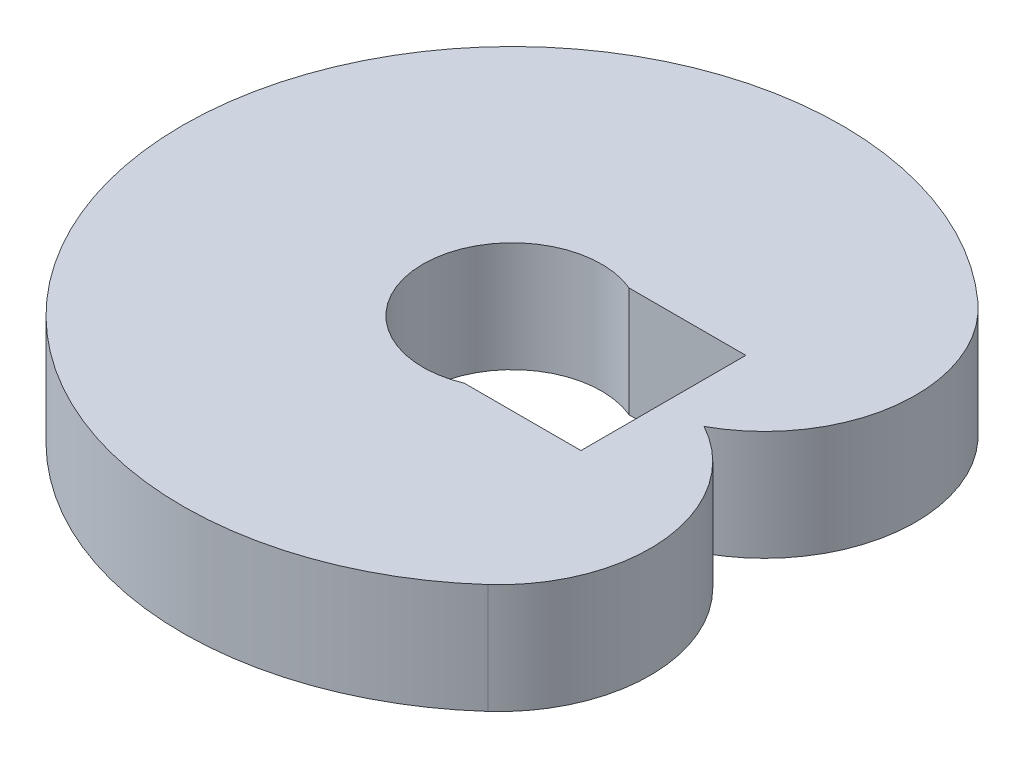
ISO-10303-21;
HEADER;
FILE_DESCRIPTION(('STEP AP214'),'2;1');
FILE_NAME('part.step','',(''),(''),'','','');
FILE_SCHEMA(('AUTOMOTIVE_DESIGN { 1 0 10303 214 1 1 1 1 }'));
ENDSEC;
DATA;
#1=APPLICATION_CONTEXT('core data for automotive mechanical design processes');
#2=APPLICATION_PROTOCOL_DEFINITION('international standard','automotive_design',2000,#1);
#3=PRODUCT_CONTEXT('',#1,'mechanical');
#4=PRODUCT('Part','Part','',(#3));
#5=PRODUCT_RELATED_PRODUCT_CATEGORY('part','',(#4));
#6=PRODUCT_DEFINITION_FORMATION('','',#4);
#7=PRODUCT_DEFINITION_CONTEXT('part definition',#1,'design');
#8=PRODUCT_DEFINITION('design','',#6,#7);
#9=PRODUCT_DEFINITION_SHAPE('','',#8);
#10=(LENGTH_UNIT() NAMED_UNIT(*) SI_UNIT(.MILLI.,.METRE.));
#11=(NAMED_UNIT(*) PLANE_ANGLE_UNIT() SI_UNIT($,.RADIAN.));
#12=(NAMED_UNIT(*) SI_UNIT($,.STERADIAN.) SOLID_ANGLE_UNIT());
#13=UNCERTAINTY_MEASURE_WITH_UNIT(LENGTH_MEASURE(1.E-05),#10,'distance_accuracy_value','');
#14=(GEOMETRIC_REPRESENTATION_CONTEXT(3) GLOBAL_UNCERTAINTY_ASSIGNED_CONTEXT((#13)) GLOBAL_UNIT_ASSIGNED_CONTEXT((#10,
#11,#12)) REPRESENTATION_CONTEXT('',''));
#15=CARTESIAN_POINT('',(0.,0.,0.));
#16=DIRECTION('',(0.,0.,1.));
#17=DIRECTION('',(1.,0.,0.));
#18=AXIS2_PLACEMENT_3D('',#15,#16,#17);
#19=CARTESIAN_POINT('',(217.46744706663,-465.,-241.522068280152));
#20=DIRECTION('',(0.,1.,0.));
#21=DIRECTION('',(0.,0.,1.));
#22=AXIS2_PLACEMENT_3D('',#19,#20,#21);
#23=CYLINDRICAL_SURFACE('',#22,275.);
#24=CARTESIAN_POINT('',(217.46744706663,-265.,-241.522068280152));
#25=DIRECTION('',(0.,1.,0.));
#26=DIRECTION('',(0.,0.,1.));
#27=AXIS2_PLACEMENT_3D('',#24,#25,#26);
#28=CIRCLE('',#27,275.);
#29=CARTESIAN_POINT('',(348.966840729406,-265.,0.));
#30=VERTEX_POINT('',#29);
#31=CARTESIAN_POINT('',(401.478363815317,-265.,-445.886895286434));
#32=VERTEX_POINT('',#31);
#33=EDGE_CURVE('E108',#30,#32,#28,.T.);
#34=ORIENTED_EDGE('',*,*,#33,.F.);
#35=DIRECTION('',(0.,1.,0.));
#36=VECTOR('',#35,1.);
#37=CARTESIAN_POINT('',(348.966840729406,-465.,0.));
#38=LINE('',#37,#36);
#39=CARTESIAN_POINT('',(348.966840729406,-465.,0.));
#40=VERTEX_POINT('',#39);
#41=EDGE_CURVE('E10',#40,#30,#38,.T.);
#42=ORIENTED_EDGE('',*,*,#41,.F.);
#43=CARTESIAN_POINT('',(217.46744706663,-465.,-241.522068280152));
#44=DIRECTION('',(0.,1.,0.));
#45=DIRECTION('',(0.,0.,1.));
#46=AXIS2_PLACEMENT_3D('',#43,#44,#45);
#47=CIRCLE('',#46,275.);
#48=CARTESIAN_POINT('',(401.478363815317,-465.,-445.886895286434));
#49=VERTEX_POINT('',#48);
#50=EDGE_CURVE('E112',#40,#49,#47,.T.);
#51=ORIENTED_EDGE('',*,*,#50,.T.);
#52=DIRECTION('',(0.,1.,0.));
#53=VECTOR('',#52,1.);
#54=CARTESIAN_POINT('',(401.478363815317,-465.,-445.886895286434));
#55=LINE('',#54,#53);
#56=EDGE_CURVE('E19',#49,#32,#55,.T.);
#57=ORIENTED_EDGE('',*,*,#56,.T.);
#58=EDGE_LOOP('',(#34,#42,#51,#57));
#59=FACE_BOUND('',#58,.T.);
#60=ADVANCED_FACE('F16',(#59),#23,.T.);
#61=CARTESIAN_POINT('',(217.46744706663,-465.,241.522068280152));
#62=DIRECTION('',(0.,1.,0.));
#63=DIRECTION('',(0.,0.,1.));
#64=AXIS2_PLACEMENT_3D('',#61,#62,#63);
#65=CYLINDRICAL_SURFACE('',#64,275.);
#66=CARTESIAN_POINT('',(217.46744706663,-265.,241.522068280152));
#67=DIRECTION('',(0.,1.,0.));
#68=DIRECTION('',(0.,0.,1.));
#69=AXIS2_PLACEMENT_3D('',#66,#67,#68);
#70=CIRCLE('',#69,275.);
#71=CARTESIAN_POINT('',(401.478363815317,-265.,445.886895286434));
#72=VERTEX_POINT('',#71);
#73=EDGE_CURVE('E116',#72,#30,#70,.T.);
#74=ORIENTED_EDGE('',*,*,#73,.F.);
#75=DIRECTION('',(0.,1.,0.));
#76=VECTOR('',#75,1.);
#77=CARTESIAN_POINT('',(401.478363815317,-465.,445.886895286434));
#78=LINE('',#77,#76);
#79=CARTESIAN_POINT('',(401.478363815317,-465.,445.886895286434));
#80=VERTEX_POINT('',#79);
#81=EDGE_CURVE('E24',#80,#72,#78,.T.);
#82=ORIENTED_EDGE('',*,*,#81,.F.);
#83=CARTESIAN_POINT('',(217.46744706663,-465.,241.522068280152));
#84=DIRECTION('',(0.,1.,0.));
#85=DIRECTION('',(0.,0.,1.));
#86=AXIS2_PLACEMENT_3D('',#83,#84,#85);
#87=CIRCLE('',#86,275.);
#88=EDGE_CURVE('E119',#80,#40,#87,.T.);
#89=ORIENTED_EDGE('',*,*,#88,.T.);
#90=ORIENTED_EDGE('',*,*,#41,.T.);
#91=EDGE_LOOP('',(#74,#82,#89,#90));
#92=FACE_BOUND('',#91,.T.);
#93=ADVANCED_FACE('F139',(#92),#65,.T.);
#94=CARTESIAN_POINT('',(0.,-465.,0.));
#95=DIRECTION('',(0.,1.,0.));
#96=DIRECTION('',(0.,0.,1.));
#97=AXIS2_PLACEMENT_3D('',#94,#95,#96);
#98=CYLINDRICAL_SURFACE('',#97,600.);
#99=CARTESIAN_POINT('',(0.,-265.,0.));
#100=DIRECTION('',(0.,1.,0.));
#101=DIRECTION('',(0.,0.,1.));
#102=AXIS2_PLACEMENT_3D('',#99,#100,#101);
#103=CIRCLE('',#102,600.);
#104=EDGE_CURVE('E124',#32,#72,#103,.T.);
#105=ORIENTED_EDGE('',*,*,#104,.F.);
#106=ORIENTED_EDGE('',*,*,#56,.F.);
#107=CARTESIAN_POINT('',(0.,-465.,0.));
#108=DIRECTION('',(0.,1.,0.));
#109=DIRECTION('',(0.,0.,1.));
#110=AXIS2_PLACEMENT_3D('',#107,#108,#109);
#111=CIRCLE('',#110,600.);
#112=EDGE_CURVE('E115',#49,#80,#111,.T.);
#113=ORIENTED_EDGE('',*,*,#112,.T.);
#114=ORIENTED_EDGE('',*,*,#81,.T.);
#115=EDGE_LOOP('',(#105,#106,#113,#114));
#116=FACE_BOUND('',#115,.T.);
#117=ADVANCED_FACE('F134',(#116),#98,.T.);
#118=CARTESIAN_POINT('',(108.733723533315,-465.,-120.761034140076));
#119=DIRECTION('',(0.,1.,0.));
#120=DIRECTION('',(0.,0.,1.));
#121=AXIS2_PLACEMENT_3D('',#118,#119,#120);
#122=PLANE('',#121);
#123=DIRECTION('',(-1.,0.,0.));
#124=VECTOR('',#123,1.);
#125=CARTESIAN_POINT('',(62.8327866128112,-465.,-150.));
#126=LINE('',#125,#124);
#127=CARTESIAN_POINT('',(275.,-465.,-150.));
#128=VERTEX_POINT('',#127);
#129=CARTESIAN_POINT('',(62.8327866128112,-465.,-150.));
#130=VERTEX_POINT('',#129);
#131=EDGE_CURVE('E83',#128,#130,#126,.T.);
#132=ORIENTED_EDGE('',*,*,#131,.T.);
#133=CARTESIAN_POINT('',(0.,-465.,0.));
#134=DIRECTION('',(0.,1.,0.));
#135=DIRECTION('',(0.,0.,1.));
#136=AXIS2_PLACEMENT_3D('',#133,#134,#135);
#137=CIRCLE('',#136,162.628284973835);
#138=CARTESIAN_POINT('',(62.8327866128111,-465.,150.));
#139=VERTEX_POINT('',#138);
#140=EDGE_CURVE('E77',#130,#139,#137,.T.);
#141=ORIENTED_EDGE('',*,*,#140,.T.);
#142=DIRECTION('',(1.,0.,0.));
#143=VECTOR('',#142,1.);
#144=CARTESIAN_POINT('',(62.8327866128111,-465.,150.));
#145=LINE('',#144,#143);
#146=CARTESIAN_POINT('',(275.,-465.,150.));
#147=VERTEX_POINT('',#146);
#148=EDGE_CURVE('E86',#139,#147,#145,.T.);
#149=ORIENTED_EDGE('',*,*,#148,.T.);
#150=DIRECTION('',(0.,0.,-1.));
#151=VECTOR('',#150,1.);
#152=CARTESIAN_POINT('',(275.,-465.,-150.));
#153=LINE('',#152,#151);
#154=EDGE_CURVE('E32',#147,#128,#153,.T.);
#155=ORIENTED_EDGE('',*,*,#154,.T.);
#156=EDGE_LOOP('',(#132,#141,#149,#155));
#157=FACE_BOUND('',#156,.T.);
#158=ORIENTED_EDGE('',*,*,#50,.F.);
#159=ORIENTED_EDGE('',*,*,#88,.F.);
#160=ORIENTED_EDGE('',*,*,#112,.F.);
#161=EDGE_LOOP('',(#158,#159,#160));
#162=FACE_BOUND('',#161,.T.);
#163=ADVANCED_FACE('F90',(#157,#162),#122,.F.);
#164=CARTESIAN_POINT('',(108.733723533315,-265.,-120.761034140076));
#165=DIRECTION('',(0.,1.,0.));
#166=DIRECTION('',(0.,0.,1.));
#167=AXIS2_PLACEMENT_3D('',#164,#165,#166);
#168=PLANE('',#167);
#169=CARTESIAN_POINT('',(0.,-265.,0.));
#170=DIRECTION('',(0.,1.,0.));
#171=DIRECTION('',(0.,0.,1.));
#172=AXIS2_PLACEMENT_3D('',#169,#170,#171);
#173=CIRCLE('',#172,162.628284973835);
#174=CARTESIAN_POINT('',(62.8327866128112,-265.,-150.));
#175=VERTEX_POINT('',#174);
#176=CARTESIAN_POINT('',(62.8327866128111,-265.,150.));
#177=VERTEX_POINT('',#176);
#178=EDGE_CURVE('E40',#175,#177,#173,.T.);
#179=ORIENTED_EDGE('',*,*,#178,.F.);
#180=DIRECTION('',(-1.,0.,0.));
#181=VECTOR('',#180,1.);
#182=CARTESIAN_POINT('',(62.8327866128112,-265.,-150.));
#183=LINE('',#182,#181);
#184=CARTESIAN_POINT('',(275.,-265.,-150.));
#185=VERTEX_POINT('',#184);
#186=EDGE_CURVE('E93',#185,#175,#183,.T.);
#187=ORIENTED_EDGE('',*,*,#186,.F.);
#188=DIRECTION('',(0.,0.,-1.));
#189=VECTOR('',#188,1.);
#190=CARTESIAN_POINT('',(275.,-265.,-150.));
#191=LINE('',#190,#189);
#192=CARTESIAN_POINT('',(275.,-265.,150.));
#193=VERTEX_POINT('',#192);
#194=EDGE_CURVE('E96',#193,#185,#191,.T.);
#195=ORIENTED_EDGE('',*,*,#194,.F.);
#196=DIRECTION('',(1.,0.,0.));
#197=VECTOR('',#196,1.);
#198=CARTESIAN_POINT('',(62.8327866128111,-265.,150.));
#199=LINE('',#198,#197);
#200=EDGE_CURVE('E102',#177,#193,#199,.T.);
#201=ORIENTED_EDGE('',*,*,#200,.F.);
#202=EDGE_LOOP('',(#179,#187,#195,#201));
#203=FACE_BOUND('',#202,.T.);
#204=ORIENTED_EDGE('',*,*,#33,.T.);
#205=ORIENTED_EDGE('',*,*,#104,.T.);
#206=ORIENTED_EDGE('',*,*,#73,.T.);
#207=EDGE_LOOP('',(#204,#205,#206));
#208=FACE_BOUND('',#207,.T.);
#209=ADVANCED_FACE('F137',(#203,#208),#168,.T.);
#210=CARTESIAN_POINT('',(0.,-465.,0.));
#211=DIRECTION('',(0.,1.,0.));
#212=DIRECTION('',(0.,0.,1.));
#213=AXIS2_PLACEMENT_3D('',#210,#211,#212);
#214=CYLINDRICAL_SURFACE('',#213,162.628284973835);
#215=ORIENTED_EDGE('',*,*,#178,.T.);
#216=DIRECTION('',(0.,1.,0.));
#217=VECTOR('',#216,1.);
#218=CARTESIAN_POINT('',(62.8327866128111,-465.,150.));
#219=LINE('',#218,#217);
#220=EDGE_CURVE('E73',#139,#177,#219,.T.);
#221=ORIENTED_EDGE('',*,*,#220,.F.);
#222=ORIENTED_EDGE('',*,*,#140,.F.);
#223=DIRECTION('',(0.,1.,0.));
#224=VECTOR('',#223,1.);
#225=CARTESIAN_POINT('',(62.8327866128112,-465.,-150.));
#226=LINE('',#225,#224);
#227=EDGE_CURVE('E106',#130,#175,#226,.T.);
#228=ORIENTED_EDGE('',*,*,#227,.T.);
#229=EDGE_LOOP('',(#215,#221,#222,#228));
#230=FACE_BOUND('',#229,.T.);
#231=ADVANCED_FACE('F75',(#230),#214,.F.);
#232=CARTESIAN_POINT('',(62.8327866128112,-465.,-150.));
#233=DIRECTION('',(0.,0.,-1.));
#234=DIRECTION('',(-1.,0.,0.));
#235=AXIS2_PLACEMENT_3D('',#232,#233,#234);
#236=PLANE('',#235);
#237=ORIENTED_EDGE('',*,*,#186,.T.);
#238=ORIENTED_EDGE('',*,*,#227,.F.);
#239=ORIENTED_EDGE('',*,*,#131,.F.);
#240=DIRECTION('',(0.,1.,0.));
#241=VECTOR('',#240,1.);
#242=CARTESIAN_POINT('',(275.,-465.,-150.));
#243=LINE('',#242,#241);
#244=EDGE_CURVE('E109',#128,#185,#243,.T.);
#245=ORIENTED_EDGE('',*,*,#244,.T.);
#246=EDGE_LOOP('',(#237,#238,#239,#245));
#247=FACE_BOUND('',#246,.T.);
#248=ADVANCED_FACE('F195',(#247),#236,.F.);
#249=CARTESIAN_POINT('',(275.,-465.,-150.));
#250=DIRECTION('',(1.,0.,0.));
#251=DIRECTION('',(0.,0.,-1.));
#252=AXIS2_PLACEMENT_3D('',#249,#250,#251);
#253=PLANE('',#252);
#254=ORIENTED_EDGE('',*,*,#194,.T.);
#255=ORIENTED_EDGE('',*,*,#244,.F.);
#256=ORIENTED_EDGE('',*,*,#154,.F.);
#257=DIRECTION('',(0.,1.,0.));
#258=VECTOR('',#257,1.);
#259=CARTESIAN_POINT('',(275.,-465.,150.));
#260=LINE('',#259,#258);
#261=EDGE_CURVE('E82',#147,#193,#260,.T.);
#262=ORIENTED_EDGE('',*,*,#261,.T.);
#263=EDGE_LOOP('',(#254,#255,#256,#262));
#264=FACE_BOUND('',#263,.T.);
#265=ADVANCED_FACE('F201',(#264),#253,.F.);
#266=CARTESIAN_POINT('',(62.8327866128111,-465.,150.));
#267=DIRECTION('',(0.,0.,1.));
#268=DIRECTION('',(1.,0.,0.));
#269=AXIS2_PLACEMENT_3D('',#266,#267,#268);
#270=PLANE('',#269);
#271=ORIENTED_EDGE('',*,*,#200,.T.);
#272=ORIENTED_EDGE('',*,*,#261,.F.);
#273=ORIENTED_EDGE('',*,*,#148,.F.);
#274=ORIENTED_EDGE('',*,*,#220,.T.);
#275=EDGE_LOOP('',(#271,#272,#273,#274));
#276=FACE_BOUND('',#275,.T.);
#277=ADVANCED_FACE('F87',(#276),#270,.F.);
#278=CLOSED_SHELL('',(#60,#93,#117,#163,#209,#231,#248,#265,#277));
#279=MANIFOLD_SOLID_BREP('B1',#278);
#280=ADVANCED_BREP_SHAPE_REPRESENTATION('',(#18,#279),#14);
#281=SHAPE_DEFINITION_REPRESENTATION(#9,#280);
ENDSEC;
END-ISO-10303-21;
